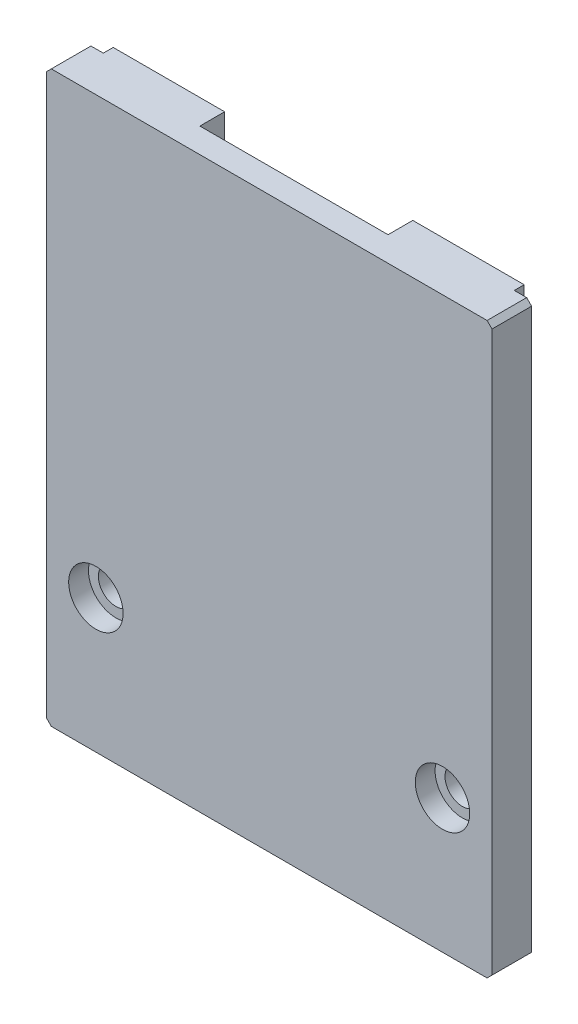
ISO-10303-21;
HEADER;
FILE_DESCRIPTION(('STEP AP214'),'2;1');
FILE_NAME('part.step','',(''),(''),'','','');
FILE_SCHEMA(('AUTOMOTIVE_DESIGN { 1 0 10303 214 1 1 1 1 }'));
ENDSEC;
DATA;
#1=APPLICATION_CONTEXT('core data for automotive mechanical design processes');
#2=APPLICATION_PROTOCOL_DEFINITION('international standard','automotive_design',2000,#1);
#3=PRODUCT_CONTEXT('',#1,'mechanical');
#4=PRODUCT('Part','Part','',(#3));
#5=PRODUCT_RELATED_PRODUCT_CATEGORY('part','',(#4));
#6=PRODUCT_DEFINITION_FORMATION('','',#4);
#7=PRODUCT_DEFINITION_CONTEXT('part definition',#1,'design');
#8=PRODUCT_DEFINITION('design','',#6,#7);
#9=PRODUCT_DEFINITION_SHAPE('','',#8);
#10=(LENGTH_UNIT() NAMED_UNIT(*) SI_UNIT(.MILLI.,.METRE.));
#11=(NAMED_UNIT(*) PLANE_ANGLE_UNIT() SI_UNIT($,.RADIAN.));
#12=(NAMED_UNIT(*) SI_UNIT($,.STERADIAN.) SOLID_ANGLE_UNIT());
#13=UNCERTAINTY_MEASURE_WITH_UNIT(LENGTH_MEASURE(1.E-05),#10,'distance_accuracy_value','');
#14=(GEOMETRIC_REPRESENTATION_CONTEXT(3) GLOBAL_UNCERTAINTY_ASSIGNED_CONTEXT((#13)) GLOBAL_UNIT_ASSIGNED_CONTEXT((#10,
#11,#12)) REPRESENTATION_CONTEXT('',''));
#15=CARTESIAN_POINT('',(0.,0.,0.));
#16=DIRECTION('',(0.,0.,1.));
#17=DIRECTION('',(1.,0.,0.));
#18=AXIS2_PLACEMENT_3D('',#15,#16,#17);
#19=CARTESIAN_POINT('',(13.,-19.,-10.));
#20=DIRECTION('',(0.,0.,1.));
#21=DIRECTION('',(1.,0.,0.));
#22=AXIS2_PLACEMENT_3D('',#19,#20,#21);
#23=CYLINDRICAL_SURFACE('',#22,6.);
#24=DIRECTION('',(0.,0.,-1.));
#25=VECTOR('',#24,1.);
#26=CARTESIAN_POINT('',(19.,-19.,-10.));
#27=LINE('',#26,#25);
#28=CARTESIAN_POINT('',(19.,-19.,-5.));
#29=VERTEX_POINT('',#28);
#30=CARTESIAN_POINT('',(19.,-19.,-10.));
#31=VERTEX_POINT('',#30);
#32=EDGE_CURVE('E165',#29,#31,#27,.T.);
#33=ORIENTED_EDGE('',*,*,#32,.T.);
#34=CARTESIAN_POINT('',(13.,-19.,-10.));
#35=DIRECTION('',(0.,0.,1.));
#36=DIRECTION('',(1.,0.,0.));
#37=AXIS2_PLACEMENT_3D('',#34,#35,#36);
#38=CIRCLE('',#37,6.);
#39=CARTESIAN_POINT('',(13.,-25.,-10.));
#40=VERTEX_POINT('',#39);
#41=EDGE_CURVE('E173',#31,#40,#38,.F.);
#42=ORIENTED_EDGE('',*,*,#41,.T.);
#43=DIRECTION('',(0.,0.,-1.));
#44=VECTOR('',#43,1.);
#45=CARTESIAN_POINT('',(13.,-25.,-10.));
#46=LINE('',#45,#44);
#47=CARTESIAN_POINT('',(13.,-25.,-5.));
#48=VERTEX_POINT('',#47);
#49=EDGE_CURVE('E234',#40,#48,#46,.F.);
#50=ORIENTED_EDGE('',*,*,#49,.T.);
#51=CARTESIAN_POINT('',(13.,-19.,-5.));
#52=DIRECTION('',(0.,0.,1.));
#53=DIRECTION('',(1.,0.,0.));
#54=AXIS2_PLACEMENT_3D('',#51,#52,#53);
#55=CIRCLE('',#54,6.);
#56=EDGE_CURVE('E212',#48,#29,#55,.T.);
#57=ORIENTED_EDGE('',*,*,#56,.T.);
#58=EDGE_LOOP('',(#33,#42,#50,#57));
#59=FACE_BOUND('',#58,.T.);
#60=ADVANCED_FACE('F16',(#59),#23,.F.);
#61=CARTESIAN_POINT('',(13.,-25.,-10.));
#62=DIRECTION('',(0.,-1.,0.));
#63=DIRECTION('',(0.,0.,-1.));
#64=AXIS2_PLACEMENT_3D('',#61,#62,#63);
#65=PLANE('',#64);
#66=ORIENTED_EDGE('',*,*,#49,.F.);
#67=DIRECTION('',(1.,0.,0.));
#68=VECTOR('',#67,1.);
#69=CARTESIAN_POINT('',(0.,-25.,-10.));
#70=LINE('',#69,#68);
#71=CARTESIAN_POINT('',(-13.,-25.,-10.));
#72=VERTEX_POINT('',#71);
#73=EDGE_CURVE('E211',#40,#72,#70,.F.);
#74=ORIENTED_EDGE('',*,*,#73,.T.);
#75=DIRECTION('',(0.,0.,1.));
#76=VECTOR('',#75,1.);
#77=CARTESIAN_POINT('',(-13.,-25.,-10.));
#78=LINE('',#77,#76);
#79=CARTESIAN_POINT('',(-13.,-25.,-5.));
#80=VERTEX_POINT('',#79);
#81=EDGE_CURVE('E226',#72,#80,#78,.T.);
#82=ORIENTED_EDGE('',*,*,#81,.T.);
#83=DIRECTION('',(1.,0.,0.));
#84=VECTOR('',#83,1.);
#85=CARTESIAN_POINT('',(0.,-25.,-5.));
#86=LINE('',#85,#84);
#87=EDGE_CURVE('E164',#80,#48,#86,.T.);
#88=ORIENTED_EDGE('',*,*,#87,.T.);
#89=EDGE_LOOP('',(#66,#74,#82,#88));
#90=FACE_BOUND('',#89,.T.);
#91=ADVANCED_FACE('F309',(#90),#65,.F.);
#92=CARTESIAN_POINT('',(-13.,-19.,-10.));
#93=DIRECTION('',(0.,0.,1.));
#94=DIRECTION('',(1.,0.,0.));
#95=AXIS2_PLACEMENT_3D('',#92,#93,#94);
#96=CYLINDRICAL_SURFACE('',#95,6.);
#97=ORIENTED_EDGE('',*,*,#81,.F.);
#98=CARTESIAN_POINT('',(-13.,-19.,-10.));
#99=DIRECTION('',(0.,0.,1.));
#100=DIRECTION('',(1.,0.,0.));
#101=AXIS2_PLACEMENT_3D('',#98,#99,#100);
#102=CIRCLE('',#101,6.);
#103=CARTESIAN_POINT('',(-19.,-19.,-10.));
#104=VERTEX_POINT('',#103);
#105=EDGE_CURVE('E151',#72,#104,#102,.F.);
#106=ORIENTED_EDGE('',*,*,#105,.T.);
#107=DIRECTION('',(0.,0.,1.));
#108=VECTOR('',#107,1.);
#109=CARTESIAN_POINT('',(-19.,-19.,-10.));
#110=LINE('',#109,#108);
#111=CARTESIAN_POINT('',(-19.,-19.,-5.));
#112=VERTEX_POINT('',#111);
#113=EDGE_CURVE('E145',#104,#112,#110,.T.);
#114=ORIENTED_EDGE('',*,*,#113,.T.);
#115=CARTESIAN_POINT('',(-13.,-19.,-5.));
#116=DIRECTION('',(0.,0.,1.));
#117=DIRECTION('',(1.,0.,0.));
#118=AXIS2_PLACEMENT_3D('',#115,#116,#117);
#119=CIRCLE('',#118,6.);
#120=EDGE_CURVE('E20',#112,#80,#119,.T.);
#121=ORIENTED_EDGE('',*,*,#120,.T.);
#122=EDGE_LOOP('',(#97,#106,#114,#121));
#123=FACE_BOUND('',#122,.T.);
#124=ADVANCED_FACE('F148',(#123),#96,.F.);
#125=CARTESIAN_POINT('',(35.,-30.5,-4.));
#126=DIRECTION('',(0.,0.,-1.));
#127=DIRECTION('',(-1.,0.,0.));
#128=AXIS2_PLACEMENT_3D('',#125,#126,#127);
#129=CYLINDRICAL_SURFACE('',#128,3.5);
#130=CARTESIAN_POINT('',(35.,-30.5,-4.));
#131=DIRECTION('',(0.,0.,-1.));
#132=DIRECTION('',(-1.,0.,0.));
#133=AXIS2_PLACEMENT_3D('',#130,#131,#132);
#134=CIRCLE('',#133,3.5);
#135=CARTESIAN_POINT('',(31.5,-30.5,-4.));
#136=VERTEX_POINT('',#135);
#137=EDGE_CURVE('E197',#136,#136,#134,.F.);
#138=ORIENTED_EDGE('',*,*,#137,.T.);
#139=EDGE_LOOP('',(#138));
#140=FACE_BOUND('',#139,.T.);
#141=CARTESIAN_POINT('',(35.,-30.5,-10.));
#142=DIRECTION('',(0.,0.,-1.));
#143=DIRECTION('',(-1.,0.,0.));
#144=AXIS2_PLACEMENT_3D('',#141,#142,#143);
#145=CIRCLE('',#144,3.5);
#146=CARTESIAN_POINT('',(31.5,-30.5,-10.));
#147=VERTEX_POINT('',#146);
#148=EDGE_CURVE('E201',#147,#147,#145,.T.);
#149=ORIENTED_EDGE('',*,*,#148,.T.);
#150=EDGE_LOOP('',(#149));
#151=FACE_BOUND('',#150,.T.);
#152=ADVANCED_FACE('F481',(#140,#151),#129,.F.);
#153=CARTESIAN_POINT('',(-35.,-30.5,-4.));
#154=DIRECTION('',(0.,0.,-1.));
#155=DIRECTION('',(-1.,0.,0.));
#156=AXIS2_PLACEMENT_3D('',#153,#154,#155);
#157=CYLINDRICAL_SURFACE('',#156,3.5);
#158=CARTESIAN_POINT('',(-35.,-30.5,-4.));
#159=DIRECTION('',(0.,0.,-1.));
#160=DIRECTION('',(-1.,0.,0.));
#161=AXIS2_PLACEMENT_3D('',#158,#159,#160);
#162=CIRCLE('',#161,3.5);
#163=CARTESIAN_POINT('',(-38.5,-30.5,-4.));
#164=VERTEX_POINT('',#163);
#165=EDGE_CURVE('E193',#164,#164,#162,.F.);
#166=ORIENTED_EDGE('',*,*,#165,.T.);
#167=EDGE_LOOP('',(#166));
#168=FACE_BOUND('',#167,.T.);
#169=CARTESIAN_POINT('',(-35.,-30.5,-10.));
#170=DIRECTION('',(0.,0.,-1.));
#171=DIRECTION('',(-1.,0.,0.));
#172=AXIS2_PLACEMENT_3D('',#169,#170,#171);
#173=CIRCLE('',#172,3.5);
#174=CARTESIAN_POINT('',(-38.5,-30.5,-10.));
#175=VERTEX_POINT('',#174);
#176=EDGE_CURVE('E205',#175,#175,#173,.T.);
#177=ORIENTED_EDGE('',*,*,#176,.T.);
#178=EDGE_LOOP('',(#177));
#179=FACE_BOUND('',#178,.T.);
#180=ADVANCED_FACE('F478',(#168,#179),#157,.F.);
#181=CARTESIAN_POINT('',(-44.5,-57.,0.));
#182=DIRECTION('',(-0.707106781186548,-0.707106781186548,0.));
#183=DIRECTION('',(0.707106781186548,-0.707106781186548,0.));
#184=AXIS2_PLACEMENT_3D('',#181,#182,#183);
#185=PLANE('',#184);
#186=DIRECTION('',(0.707106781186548,-0.707106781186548,0.));
#187=VECTOR('',#186,1.);
#188=CARTESIAN_POINT('',(-44.5,-57.,0.));
#189=LINE('',#188,#187);
#190=CARTESIAN_POINT('',(-44.,-57.5,0.));
#191=VERTEX_POINT('',#190);
#192=CARTESIAN_POINT('',(-45.,-56.5,0.));
#193=VERTEX_POINT('',#192);
#194=EDGE_CURVE('E225',#191,#193,#189,.F.);
#195=ORIENTED_EDGE('',*,*,#194,.T.);
#196=DIRECTION('',(0.,0.,1.));
#197=VECTOR('',#196,1.);
#198=CARTESIAN_POINT('',(-45.,-56.5,0.));
#199=LINE('',#198,#197);
#200=CARTESIAN_POINT('',(-45.,-56.5,-8.));
#201=VERTEX_POINT('',#200);
#202=EDGE_CURVE('E281',#201,#193,#199,.T.);
#203=ORIENTED_EDGE('',*,*,#202,.F.);
#204=DIRECTION('',(0.707106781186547,-0.707106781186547,0.));
#205=VECTOR('',#204,1.);
#206=CARTESIAN_POINT('',(-45.,-56.5,-8.));
#207=LINE('',#206,#205);
#208=CARTESIAN_POINT('',(-44.,-57.5,-8.));
#209=VERTEX_POINT('',#208);
#210=EDGE_CURVE('E299',#201,#209,#207,.T.);
#211=ORIENTED_EDGE('',*,*,#210,.T.);
#212=DIRECTION('',(0.,0.,-1.));
#213=VECTOR('',#212,1.);
#214=CARTESIAN_POINT('',(-44.,-57.5,0.));
#215=LINE('',#214,#213);
#216=EDGE_CURVE('E266',#191,#209,#215,.T.);
#217=ORIENTED_EDGE('',*,*,#216,.F.);
#218=EDGE_LOOP('',(#195,#203,#211,#217));
#219=FACE_BOUND('',#218,.T.);
#220=ADVANCED_FACE('F365',(#219),#185,.T.);
#221=CARTESIAN_POINT('',(-22.5,-57.,-9.5));
#222=DIRECTION('',(0.,-0.707106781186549,-0.707106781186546));
#223=DIRECTION('',(0.,0.707106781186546,-0.707106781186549));
#224=AXIS2_PLACEMENT_3D('',#221,#222,#223);
#225=PLANE('',#224);
#226=DIRECTION('',(0.,0.707106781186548,-0.707106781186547));
#227=VECTOR('',#226,1.);
#228=CARTESIAN_POINT('',(-41.5,-57.5,-9.));
#229=LINE('',#228,#227);
#230=CARTESIAN_POINT('',(-41.5,-57.5,-9.));
#231=VERTEX_POINT('',#230);
#232=CARTESIAN_POINT('',(-41.5,-56.5,-10.));
#233=VERTEX_POINT('',#232);
#234=EDGE_CURVE('E204',#231,#233,#229,.T.);
#235=ORIENTED_EDGE('',*,*,#234,.T.);
#236=DIRECTION('',(1.,0.,0.));
#237=VECTOR('',#236,1.);
#238=CARTESIAN_POINT('',(0.,-56.5,-10.));
#239=LINE('',#238,#237);
#240=CARTESIAN_POINT('',(41.5,-56.5,-10.));
#241=VERTEX_POINT('',#240);
#242=EDGE_CURVE('E305',#233,#241,#239,.T.);
#243=ORIENTED_EDGE('',*,*,#242,.T.);
#244=DIRECTION('',(0.,-0.707106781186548,0.707106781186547));
#245=VECTOR('',#244,1.);
#246=CARTESIAN_POINT('',(41.5,-56.5,-10.));
#247=LINE('',#246,#245);
#248=CARTESIAN_POINT('',(41.5,-57.5,-9.));
#249=VERTEX_POINT('',#248);
#250=EDGE_CURVE('E221',#241,#249,#247,.T.);
#251=ORIENTED_EDGE('',*,*,#250,.T.);
#252=DIRECTION('',(1.,0.,0.));
#253=VECTOR('',#252,1.);
#254=CARTESIAN_POINT('',(-45.,-57.5,-9.));
#255=LINE('',#254,#253);
#256=EDGE_CURVE('E257',#231,#249,#255,.T.);
#257=ORIENTED_EDGE('',*,*,#256,.F.);
#258=EDGE_LOOP('',(#235,#243,#251,#257));
#259=FACE_BOUND('',#258,.T.);
#260=ADVANCED_FACE('F331',(#259),#225,.T.);
#261=CARTESIAN_POINT('',(44.5,-57.,0.));
#262=DIRECTION('',(0.707106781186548,-0.707106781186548,0.));
#263=DIRECTION('',(0.707106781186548,0.707106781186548,0.));
#264=AXIS2_PLACEMENT_3D('',#261,#262,#263);
#265=PLANE('',#264);
#266=DIRECTION('',(0.707106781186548,0.707106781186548,0.));
#267=VECTOR('',#266,1.);
#268=CARTESIAN_POINT('',(44.5,-57.,0.));
#269=LINE('',#268,#267);
#270=CARTESIAN_POINT('',(45.,-56.5,0.));
#271=VERTEX_POINT('',#270);
#272=CARTESIAN_POINT('',(44.,-57.5,0.));
#273=VERTEX_POINT('',#272);
#274=EDGE_CURVE('E223',#271,#273,#269,.F.);
#275=ORIENTED_EDGE('',*,*,#274,.T.);
#276=DIRECTION('',(0.,0.,-1.));
#277=VECTOR('',#276,1.);
#278=CARTESIAN_POINT('',(44.,-57.5,0.));
#279=LINE('',#278,#277);
#280=CARTESIAN_POINT('',(44.,-57.5,-8.));
#281=VERTEX_POINT('',#280);
#282=EDGE_CURVE('E269',#281,#273,#279,.F.);
#283=ORIENTED_EDGE('',*,*,#282,.F.);
#284=DIRECTION('',(0.707106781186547,0.707106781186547,0.));
#285=VECTOR('',#284,1.);
#286=CARTESIAN_POINT('',(44.,-57.5,-8.));
#287=LINE('',#286,#285);
#288=CARTESIAN_POINT('',(45.,-56.5,-8.));
#289=VERTEX_POINT('',#288);
#290=EDGE_CURVE('E287',#281,#289,#287,.T.);
#291=ORIENTED_EDGE('',*,*,#290,.T.);
#292=DIRECTION('',(0.,0.,-1.));
#293=VECTOR('',#292,1.);
#294=CARTESIAN_POINT('',(45.,-56.5,0.));
#295=LINE('',#294,#293);
#296=EDGE_CURVE('E243',#271,#289,#295,.T.);
#297=ORIENTED_EDGE('',*,*,#296,.F.);
#298=EDGE_LOOP('',(#275,#283,#291,#297));
#299=FACE_BOUND('',#298,.T.);
#300=ADVANCED_FACE('F372',(#299),#265,.T.);
#301=CARTESIAN_POINT('',(41.5,-57.5,-8.));
#302=DIRECTION('',(-1.,0.,0.));
#303=DIRECTION('',(0.,0.,1.));
#304=AXIS2_PLACEMENT_3D('',#301,#302,#303);
#305=PLANE('',#304);
#306=DIRECTION('',(0.,1.,0.));
#307=VECTOR('',#306,1.);
#308=CARTESIAN_POINT('',(41.5,-57.5,-8.));
#309=LINE('',#308,#307);
#310=CARTESIAN_POINT('',(41.5,57.5,-8.));
#311=VERTEX_POINT('',#310);
#312=CARTESIAN_POINT('',(41.5,-57.5,-8.));
#313=VERTEX_POINT('',#312);
#314=EDGE_CURVE('E289',#311,#313,#309,.F.);
#315=ORIENTED_EDGE('',*,*,#314,.T.);
#316=DIRECTION('',(0.,0.,-1.));
#317=VECTOR('',#316,1.);
#318=CARTESIAN_POINT('',(41.5,-57.5,0.));
#319=LINE('',#318,#317);
#320=EDGE_CURVE('E275',#249,#313,#319,.F.);
#321=ORIENTED_EDGE('',*,*,#320,.F.);
#322=ORIENTED_EDGE('',*,*,#250,.F.);
#323=DIRECTION('',(0.,1.,0.));
#324=VECTOR('',#323,1.);
#325=CARTESIAN_POINT('',(41.5,0.,-10.));
#326=LINE('',#325,#324);
#327=CARTESIAN_POINT('',(41.5,57.5,-10.));
#328=VERTEX_POINT('',#327);
#329=EDGE_CURVE('E208',#241,#328,#326,.T.);
#330=ORIENTED_EDGE('',*,*,#329,.T.);
#331=DIRECTION('',(0.,0.,1.));
#332=VECTOR('',#331,1.);
#333=CARTESIAN_POINT('',(41.5,57.5,0.));
#334=LINE('',#333,#332);
#335=EDGE_CURVE('E240',#311,#328,#334,.F.);
#336=ORIENTED_EDGE('',*,*,#335,.F.);
#337=EDGE_LOOP('',(#315,#321,#322,#330,#336));
#338=FACE_BOUND('',#337,.T.);
#339=ADVANCED_FACE('F326',(#338),#305,.F.);
#340=CARTESIAN_POINT('',(19.,57.5,-10.));
#341=DIRECTION('',(1.,0.,0.));
#342=DIRECTION('',(0.,0.,-1.));
#343=AXIS2_PLACEMENT_3D('',#340,#341,#342);
#344=PLANE('',#343);
#345=DIRECTION('',(0.,0.,1.));
#346=VECTOR('',#345,1.);
#347=CARTESIAN_POINT('',(19.,57.5,0.));
#348=LINE('',#347,#346);
#349=CARTESIAN_POINT('',(19.,57.5,-10.));
#350=VERTEX_POINT('',#349);
#351=CARTESIAN_POINT('',(19.,57.5,-5.));
#352=VERTEX_POINT('',#351);
#353=EDGE_CURVE('E180',#350,#352,#348,.T.);
#354=ORIENTED_EDGE('',*,*,#353,.F.);
#355=DIRECTION('',(0.,1.,0.));
#356=VECTOR('',#355,1.);
#357=CARTESIAN_POINT('',(19.,0.,-10.));
#358=LINE('',#357,#356);
#359=EDGE_CURVE('E170',#350,#31,#358,.F.);
#360=ORIENTED_EDGE('',*,*,#359,.T.);
#361=ORIENTED_EDGE('',*,*,#32,.F.);
#362=DIRECTION('',(0.,1.,0.));
#363=VECTOR('',#362,1.);
#364=CARTESIAN_POINT('',(19.,17.1789500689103,-5.));
#365=LINE('',#364,#363);
#366=EDGE_CURVE('E156',#29,#352,#365,.T.);
#367=ORIENTED_EDGE('',*,*,#366,.T.);
#368=EDGE_LOOP('',(#354,#360,#361,#367));
#369=FACE_BOUND('',#368,.T.);
#370=ADVANCED_FACE('F322',(#369),#344,.F.);
#371=CARTESIAN_POINT('',(0.,17.1789500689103,-5.));
#372=DIRECTION('',(0.,0.,1.));
#373=DIRECTION('',(1.,0.,0.));
#374=AXIS2_PLACEMENT_3D('',#371,#372,#373);
#375=PLANE('',#374);
#376=ORIENTED_EDGE('',*,*,#56,.F.);
#377=ORIENTED_EDGE('',*,*,#87,.F.);
#378=ORIENTED_EDGE('',*,*,#120,.F.);
#379=DIRECTION('',(0.,1.,0.));
#380=VECTOR('',#379,1.);
#381=CARTESIAN_POINT('',(-19.,-19.,-5.));
#382=LINE('',#381,#380);
#383=CARTESIAN_POINT('',(-19.,57.5,-5.));
#384=VERTEX_POINT('',#383);
#385=EDGE_CURVE('E155',#112,#384,#382,.T.);
#386=ORIENTED_EDGE('',*,*,#385,.T.);
#387=DIRECTION('',(1.,0.,0.));
#388=VECTOR('',#387,1.);
#389=CARTESIAN_POINT('',(45.,57.5,-5.));
#390=LINE('',#389,#388);
#391=EDGE_CURVE('E179',#352,#384,#390,.F.);
#392=ORIENTED_EDGE('',*,*,#391,.F.);
#393=ORIENTED_EDGE('',*,*,#366,.F.);
#394=EDGE_LOOP('',(#376,#377,#378,#386,#392,#393));
#395=FACE_BOUND('',#394,.T.);
#396=ADVANCED_FACE('F160',(#395),#375,.F.);
#397=CARTESIAN_POINT('',(-19.,-19.,-10.));
#398=DIRECTION('',(-1.,0.,0.));
#399=DIRECTION('',(0.,0.,1.));
#400=AXIS2_PLACEMENT_3D('',#397,#398,#399);
#401=PLANE('',#400);
#402=ORIENTED_EDGE('',*,*,#113,.F.);
#403=DIRECTION('',(0.,1.,0.));
#404=VECTOR('',#403,1.);
#405=CARTESIAN_POINT('',(-19.,0.,-10.));
#406=LINE('',#405,#404);
#407=CARTESIAN_POINT('',(-19.,57.5,-10.));
#408=VERTEX_POINT('',#407);
#409=EDGE_CURVE('E210',#104,#408,#406,.T.);
#410=ORIENTED_EDGE('',*,*,#409,.T.);
#411=DIRECTION('',(0.,0.,1.));
#412=VECTOR('',#411,1.);
#413=CARTESIAN_POINT('',(-19.,57.5,0.));
#414=LINE('',#413,#412);
#415=EDGE_CURVE('E168',#384,#408,#414,.F.);
#416=ORIENTED_EDGE('',*,*,#415,.F.);
#417=ORIENTED_EDGE('',*,*,#385,.F.);
#418=EDGE_LOOP('',(#402,#410,#416,#417));
#419=FACE_BOUND('',#418,.T.);
#420=ADVANCED_FACE('F166',(#419),#401,.F.);
#421=CARTESIAN_POINT('',(0.,0.,-10.));
#422=DIRECTION('',(0.,0.,1.));
#423=DIRECTION('',(1.,0.,0.));
#424=AXIS2_PLACEMENT_3D('',#421,#422,#423);
#425=PLANE('',#424);
#426=ORIENTED_EDGE('',*,*,#148,.F.);
#427=EDGE_LOOP('',(#426));
#428=FACE_BOUND('',#427,.T.);
#429=ORIENTED_EDGE('',*,*,#176,.F.);
#430=EDGE_LOOP('',(#429));
#431=FACE_BOUND('',#430,.T.);
#432=ORIENTED_EDGE('',*,*,#242,.F.);
#433=DIRECTION('',(0.,1.,0.));
#434=VECTOR('',#433,1.);
#435=CARTESIAN_POINT('',(-41.5,-57.5,-10.));
#436=LINE('',#435,#434);
#437=CARTESIAN_POINT('',(-41.5,57.5,-10.));
#438=VERTEX_POINT('',#437);
#439=EDGE_CURVE('E301',#233,#438,#436,.T.);
#440=ORIENTED_EDGE('',*,*,#439,.T.);
#441=DIRECTION('',(1.,0.,0.));
#442=VECTOR('',#441,1.);
#443=CARTESIAN_POINT('',(45.,57.5,-10.));
#444=LINE('',#443,#442);
#445=EDGE_CURVE('E228',#408,#438,#444,.F.);
#446=ORIENTED_EDGE('',*,*,#445,.F.);
#447=ORIENTED_EDGE('',*,*,#409,.F.);
#448=ORIENTED_EDGE('',*,*,#105,.F.);
#449=ORIENTED_EDGE('',*,*,#73,.F.);
#450=ORIENTED_EDGE('',*,*,#41,.F.);
#451=ORIENTED_EDGE('',*,*,#359,.F.);
#452=DIRECTION('',(1.,0.,0.));
#453=VECTOR('',#452,1.);
#454=CARTESIAN_POINT('',(45.,57.5,-10.));
#455=LINE('',#454,#453);
#456=EDGE_CURVE('E177',#328,#350,#455,.F.);
#457=ORIENTED_EDGE('',*,*,#456,.F.);
#458=ORIENTED_EDGE('',*,*,#329,.F.);
#459=EDGE_LOOP('',(#432,#440,#446,#447,#448,#449,#450,#451,#457,#458));
#460=FACE_BOUND('',#459,.T.);
#461=ADVANCED_FACE('F313',(#428,#431,#460),#425,.F.);
#462=CARTESIAN_POINT('',(-41.5,-57.5,-10.));
#463=DIRECTION('',(1.,0.,0.));
#464=DIRECTION('',(0.,0.,-1.));
#465=AXIS2_PLACEMENT_3D('',#462,#463,#464);
#466=PLANE('',#465);
#467=ORIENTED_EDGE('',*,*,#439,.F.);
#468=ORIENTED_EDGE('',*,*,#234,.F.);
#469=DIRECTION('',(0.,0.,-1.));
#470=VECTOR('',#469,1.);
#471=CARTESIAN_POINT('',(-41.5,-57.5,0.));
#472=LINE('',#471,#470);
#473=CARTESIAN_POINT('',(-41.5,-57.5,-8.));
#474=VERTEX_POINT('',#473);
#475=EDGE_CURVE('E260',#474,#231,#472,.T.);
#476=ORIENTED_EDGE('',*,*,#475,.F.);
#477=DIRECTION('',(0.,1.,0.));
#478=VECTOR('',#477,1.);
#479=CARTESIAN_POINT('',(-41.5,-57.5,-8.));
#480=LINE('',#479,#478);
#481=CARTESIAN_POINT('',(-41.5,57.5,-8.));
#482=VERTEX_POINT('',#481);
#483=EDGE_CURVE('E297',#474,#482,#480,.T.);
#484=ORIENTED_EDGE('',*,*,#483,.T.);
#485=DIRECTION('',(0.,0.,1.));
#486=VECTOR('',#485,1.);
#487=CARTESIAN_POINT('',(-41.5,57.5,0.));
#488=LINE('',#487,#486);
#489=EDGE_CURVE('E231',#438,#482,#488,.T.);
#490=ORIENTED_EDGE('',*,*,#489,.F.);
#491=EDGE_LOOP('',(#467,#468,#476,#484,#490));
#492=FACE_BOUND('',#491,.T.);
#493=ADVANCED_FACE('F334',(#492),#466,.F.);
#494=CARTESIAN_POINT('',(-41.5,-57.5,-8.));
#495=DIRECTION('',(0.,0.,1.));
#496=DIRECTION('',(1.,0.,0.));
#497=AXIS2_PLACEMENT_3D('',#494,#495,#496);
#498=PLANE('',#497);
#499=ORIENTED_EDGE('',*,*,#483,.F.);
#500=DIRECTION('',(1.,0.,0.));
#501=VECTOR('',#500,1.);
#502=CARTESIAN_POINT('',(-45.,-57.5,-8.));
#503=LINE('',#502,#501);
#504=EDGE_CURVE('E263',#209,#474,#503,.T.);
#505=ORIENTED_EDGE('',*,*,#504,.F.);
#506=ORIENTED_EDGE('',*,*,#210,.F.);
#507=DIRECTION('',(0.,1.,0.));
#508=VECTOR('',#507,1.);
#509=CARTESIAN_POINT('',(-45.,57.5,-8.));
#510=LINE('',#509,#508);
#511=CARTESIAN_POINT('',(-45.,56.5,-8.));
#512=VERTEX_POINT('',#511);
#513=EDGE_CURVE('E196',#512,#201,#510,.F.);
#514=ORIENTED_EDGE('',*,*,#513,.F.);
#515=DIRECTION('',(-0.707106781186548,-0.707106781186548,0.));
#516=VECTOR('',#515,1.);
#517=CARTESIAN_POINT('',(-44.5,57.,-8.));
#518=LINE('',#517,#516);
#519=CARTESIAN_POINT('',(-44.,57.5,-8.));
#520=VERTEX_POINT('',#519);
#521=EDGE_CURVE('E294',#520,#512,#518,.T.);
#522=ORIENTED_EDGE('',*,*,#521,.F.);
#523=DIRECTION('',(1.,0.,0.));
#524=VECTOR('',#523,1.);
#525=CARTESIAN_POINT('',(45.,57.5,-8.));
#526=LINE('',#525,#524);
#527=EDGE_CURVE('E337',#482,#520,#526,.F.);
#528=ORIENTED_EDGE('',*,*,#527,.F.);
#529=EDGE_LOOP('',(#499,#505,#506,#514,#522,#528));
#530=FACE_BOUND('',#529,.T.);
#531=ADVANCED_FACE('F385',(#530),#498,.F.);
#532=CARTESIAN_POINT('',(-44.5,57.,0.));
#533=DIRECTION('',(-0.707106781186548,0.707106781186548,0.));
#534=DIRECTION('',(-0.707106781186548,-0.707106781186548,0.));
#535=AXIS2_PLACEMENT_3D('',#532,#533,#534);
#536=PLANE('',#535);
#537=DIRECTION('',(-0.707106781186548,-0.707106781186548,0.));
#538=VECTOR('',#537,1.);
#539=CARTESIAN_POINT('',(-44.5,57.,0.));
#540=LINE('',#539,#538);
#541=CARTESIAN_POINT('',(-45.,56.5,0.));
#542=VERTEX_POINT('',#541);
#543=CARTESIAN_POINT('',(-44.,57.5,0.));
#544=VERTEX_POINT('',#543);
#545=EDGE_CURVE('E292',#542,#544,#540,.F.);
#546=ORIENTED_EDGE('',*,*,#545,.T.);
#547=DIRECTION('',(0.,0.,1.));
#548=VECTOR('',#547,1.);
#549=CARTESIAN_POINT('',(-44.,57.5,0.));
#550=LINE('',#549,#548);
#551=EDGE_CURVE('E338',#520,#544,#550,.T.);
#552=ORIENTED_EDGE('',*,*,#551,.F.);
#553=ORIENTED_EDGE('',*,*,#521,.T.);
#554=DIRECTION('',(0.,0.,1.));
#555=VECTOR('',#554,1.);
#556=CARTESIAN_POINT('',(-45.,56.5,0.));
#557=LINE('',#556,#555);
#558=EDGE_CURVE('E278',#542,#512,#557,.F.);
#559=ORIENTED_EDGE('',*,*,#558,.F.);
#560=EDGE_LOOP('',(#546,#552,#553,#559));
#561=FACE_BOUND('',#560,.T.);
#562=ADVANCED_FACE('F357',(#561),#536,.T.);
#563=CARTESIAN_POINT('',(44.5,57.,0.));
#564=DIRECTION('',(0.707106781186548,0.707106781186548,0.));
#565=DIRECTION('',(-0.707106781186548,0.707106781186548,0.));
#566=AXIS2_PLACEMENT_3D('',#563,#564,#565);
#567=PLANE('',#566);
#568=DIRECTION('',(-0.707106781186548,0.707106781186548,0.));
#569=VECTOR('',#568,1.);
#570=CARTESIAN_POINT('',(44.5,57.,0.));
#571=LINE('',#570,#569);
#572=CARTESIAN_POINT('',(44.,57.5,0.));
#573=VERTEX_POINT('',#572);
#574=CARTESIAN_POINT('',(45.,56.5,0.));
#575=VERTEX_POINT('',#574);
#576=EDGE_CURVE('E35',#573,#575,#571,.F.);
#577=ORIENTED_EDGE('',*,*,#576,.T.);
#578=DIRECTION('',(0.,0.,-1.));
#579=VECTOR('',#578,1.);
#580=CARTESIAN_POINT('',(45.,56.5,0.));
#581=LINE('',#580,#579);
#582=CARTESIAN_POINT('',(45.,56.5,-8.));
#583=VERTEX_POINT('',#582);
#584=EDGE_CURVE('E247',#583,#575,#581,.F.);
#585=ORIENTED_EDGE('',*,*,#584,.F.);
#586=DIRECTION('',(-0.70710678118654,0.707106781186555,0.));
#587=VECTOR('',#586,1.);
#588=CARTESIAN_POINT('',(45.,56.5,-8.));
#589=LINE('',#588,#587);
#590=CARTESIAN_POINT('',(44.,57.5,-8.));
#591=VERTEX_POINT('',#590);
#592=EDGE_CURVE('E200',#583,#591,#589,.T.);
#593=ORIENTED_EDGE('',*,*,#592,.T.);
#594=DIRECTION('',(0.,0.,1.));
#595=VECTOR('',#594,1.);
#596=CARTESIAN_POINT('',(44.,57.5,0.));
#597=LINE('',#596,#595);
#598=EDGE_CURVE('E340',#573,#591,#597,.F.);
#599=ORIENTED_EDGE('',*,*,#598,.F.);
#600=EDGE_LOOP('',(#577,#585,#593,#599));
#601=FACE_BOUND('',#600,.T.);
#602=ADVANCED_FACE('F380',(#601),#567,.T.);
#603=CARTESIAN_POINT('',(45.,-57.5,-8.));
#604=DIRECTION('',(0.,0.,1.));
#605=DIRECTION('',(1.,0.,0.));
#606=AXIS2_PLACEMENT_3D('',#603,#604,#605);
#607=PLANE('',#606);
#608=ORIENTED_EDGE('',*,*,#592,.F.);
#609=DIRECTION('',(0.,1.,0.));
#610=VECTOR('',#609,1.);
#611=CARTESIAN_POINT('',(45.,-57.5,-8.));
#612=LINE('',#611,#610);
#613=EDGE_CURVE('E254',#289,#583,#612,.T.);
#614=ORIENTED_EDGE('',*,*,#613,.F.);
#615=ORIENTED_EDGE('',*,*,#290,.F.);
#616=DIRECTION('',(1.,0.,0.));
#617=VECTOR('',#616,1.);
#618=CARTESIAN_POINT('',(-45.,-57.5,-8.));
#619=LINE('',#618,#617);
#620=EDGE_CURVE('E272',#313,#281,#619,.T.);
#621=ORIENTED_EDGE('',*,*,#620,.F.);
#622=ORIENTED_EDGE('',*,*,#314,.F.);
#623=DIRECTION('',(1.,0.,0.));
#624=VECTOR('',#623,1.);
#625=CARTESIAN_POINT('',(45.,57.5,-8.));
#626=LINE('',#625,#624);
#627=EDGE_CURVE('E192',#591,#311,#626,.F.);
#628=ORIENTED_EDGE('',*,*,#627,.F.);
#629=EDGE_LOOP('',(#608,#614,#615,#621,#622,#628));
#630=FACE_BOUND('',#629,.T.);
#631=ADVANCED_FACE('F383',(#630),#607,.F.);
#632=CARTESIAN_POINT('',(29.39,-24.89,-4.));
#633=DIRECTION('',(0.,0.,-1.));
#634=DIRECTION('',(1.,0.,0.));
#635=AXIS2_PLACEMENT_3D('',#632,#633,#634);
#636=PLANE('',#635);
#637=ORIENTED_EDGE('',*,*,#137,.F.);
#638=EDGE_LOOP('',(#637));
#639=FACE_BOUND('',#638,.T.);
#640=CARTESIAN_POINT('',(35.,-30.5,-4.));
#641=DIRECTION('',(0.,0.,-1.));
#642=DIRECTION('',(-1.,0.,0.));
#643=AXIS2_PLACEMENT_3D('',#640,#641,#642);
#644=CIRCLE('',#643,5.49999999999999);
#645=CARTESIAN_POINT('',(29.5,-30.5,-4.));
#646=VERTEX_POINT('',#645);
#647=EDGE_CURVE('E189',#646,#646,#644,.F.);
#648=ORIENTED_EDGE('',*,*,#647,.T.);
#649=EDGE_LOOP('',(#648));
#650=FACE_BOUND('',#649,.T.);
#651=ADVANCED_FACE('F416',(#639,#650),#636,.F.);
#652=CARTESIAN_POINT('',(-40.61,-24.89,-4.));
#653=DIRECTION('',(0.,0.,-1.));
#654=DIRECTION('',(1.,0.,0.));
#655=AXIS2_PLACEMENT_3D('',#652,#653,#654);
#656=PLANE('',#655);
#657=ORIENTED_EDGE('',*,*,#165,.F.);
#658=EDGE_LOOP('',(#657));
#659=FACE_BOUND('',#658,.T.);
#660=CARTESIAN_POINT('',(-35.,-30.5,-4.));
#661=DIRECTION('',(0.,0.,-1.));
#662=DIRECTION('',(-1.,0.,0.));
#663=AXIS2_PLACEMENT_3D('',#660,#661,#662);
#664=CIRCLE('',#663,5.50000000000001);
#665=CARTESIAN_POINT('',(-40.5,-30.5,-4.));
#666=VERTEX_POINT('',#665);
#667=EDGE_CURVE('E185',#666,#666,#664,.F.);
#668=ORIENTED_EDGE('',*,*,#667,.T.);
#669=EDGE_LOOP('',(#668));
#670=FACE_BOUND('',#669,.T.);
#671=ADVANCED_FACE('F413',(#659,#670),#656,.F.);
#672=CARTESIAN_POINT('',(-45.,57.5,0.));
#673=DIRECTION('',(-1.,0.,0.));
#674=DIRECTION('',(0.,0.,1.));
#675=AXIS2_PLACEMENT_3D('',#672,#673,#674);
#676=PLANE('',#675);
#677=DIRECTION('',(0.,1.,0.));
#678=VECTOR('',#677,1.);
#679=CARTESIAN_POINT('',(-45.,0.,0.));
#680=LINE('',#679,#678);
#681=EDGE_CURVE('E188',#542,#193,#680,.F.);
#682=ORIENTED_EDGE('',*,*,#681,.F.);
#683=ORIENTED_EDGE('',*,*,#558,.T.);
#684=ORIENTED_EDGE('',*,*,#513,.T.);
#685=ORIENTED_EDGE('',*,*,#202,.T.);
#686=EDGE_LOOP('',(#682,#683,#684,#685));
#687=FACE_BOUND('',#686,.T.);
#688=ADVANCED_FACE('F360',(#687),#676,.T.);
#689=CARTESIAN_POINT('',(-45.,-57.5,0.));
#690=DIRECTION('',(0.,-1.,0.));
#691=DIRECTION('',(0.,0.,-1.));
#692=AXIS2_PLACEMENT_3D('',#689,#690,#691);
#693=PLANE('',#692);
#694=ORIENTED_EDGE('',*,*,#475,.T.);
#695=ORIENTED_EDGE('',*,*,#256,.T.);
#696=ORIENTED_EDGE('',*,*,#320,.T.);
#697=ORIENTED_EDGE('',*,*,#620,.T.);
#698=ORIENTED_EDGE('',*,*,#282,.T.);
#699=DIRECTION('',(1.,0.,0.));
#700=VECTOR('',#699,1.);
#701=CARTESIAN_POINT('',(0.,-57.5,0.));
#702=LINE('',#701,#700);
#703=EDGE_CURVE('E347',#191,#273,#702,.T.);
#704=ORIENTED_EDGE('',*,*,#703,.F.);
#705=ORIENTED_EDGE('',*,*,#216,.T.);
#706=ORIENTED_EDGE('',*,*,#504,.T.);
#707=EDGE_LOOP('',(#694,#695,#696,#697,#698,#704,#705,#706));
#708=FACE_BOUND('',#707,.T.);
#709=ADVANCED_FACE('F368',(#708),#693,.T.);
#710=CARTESIAN_POINT('',(45.,-57.5,0.));
#711=DIRECTION('',(1.,0.,0.));
#712=DIRECTION('',(0.,0.,-1.));
#713=AXIS2_PLACEMENT_3D('',#710,#711,#712);
#714=PLANE('',#713);
#715=DIRECTION('',(0.,1.,0.));
#716=VECTOR('',#715,1.);
#717=CARTESIAN_POINT('',(45.,0.,0.));
#718=LINE('',#717,#716);
#719=EDGE_CURVE('E350',#271,#575,#718,.T.);
#720=ORIENTED_EDGE('',*,*,#719,.F.);
#721=ORIENTED_EDGE('',*,*,#296,.T.);
#722=ORIENTED_EDGE('',*,*,#613,.T.);
#723=ORIENTED_EDGE('',*,*,#584,.T.);
#724=EDGE_LOOP('',(#720,#721,#722,#723));
#725=FACE_BOUND('',#724,.T.);
#726=ADVANCED_FACE('F377',(#725),#714,.T.);
#727=CARTESIAN_POINT('',(45.,57.5,0.));
#728=DIRECTION('',(0.,1.,0.));
#729=DIRECTION('',(0.,0.,1.));
#730=AXIS2_PLACEMENT_3D('',#727,#728,#729);
#731=PLANE('',#730);
#732=ORIENTED_EDGE('',*,*,#598,.T.);
#733=ORIENTED_EDGE('',*,*,#627,.T.);
#734=ORIENTED_EDGE('',*,*,#335,.T.);
#735=ORIENTED_EDGE('',*,*,#456,.T.);
#736=ORIENTED_EDGE('',*,*,#353,.T.);
#737=ORIENTED_EDGE('',*,*,#391,.T.);
#738=ORIENTED_EDGE('',*,*,#415,.T.);
#739=ORIENTED_EDGE('',*,*,#445,.T.);
#740=ORIENTED_EDGE('',*,*,#489,.T.);
#741=ORIENTED_EDGE('',*,*,#527,.T.);
#742=ORIENTED_EDGE('',*,*,#551,.T.);
#743=DIRECTION('',(1.,0.,0.));
#744=VECTOR('',#743,1.);
#745=CARTESIAN_POINT('',(0.,57.5,0.));
#746=LINE('',#745,#744);
#747=EDGE_CURVE('E184',#573,#544,#746,.F.);
#748=ORIENTED_EDGE('',*,*,#747,.F.);
#749=EDGE_LOOP('',(#732,#733,#734,#735,#736,#737,#738,#739,#740,#741,#742,#748));
#750=FACE_BOUND('',#749,.T.);
#751=ADVANCED_FACE('F319',(#750),#731,.T.);
#752=CARTESIAN_POINT('',(35.,-30.5,0.));
#753=DIRECTION('',(0.,0.,-1.));
#754=DIRECTION('',(-1.,0.,0.));
#755=AXIS2_PLACEMENT_3D('',#752,#753,#754);
#756=CYLINDRICAL_SURFACE('',#755,5.49999999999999);
#757=ORIENTED_EDGE('',*,*,#647,.F.);
#758=EDGE_LOOP('',(#757));
#759=FACE_BOUND('',#758,.T.);
#760=CARTESIAN_POINT('',(35.,-30.5,0.));
#761=DIRECTION('',(0.,0.,-1.));
#762=DIRECTION('',(-1.,0.,0.));
#763=AXIS2_PLACEMENT_3D('',#760,#761,#762);
#764=CIRCLE('',#763,5.49999999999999);
#765=CARTESIAN_POINT('',(29.5,-30.5,0.));
#766=VERTEX_POINT('',#765);
#767=EDGE_CURVE('E26',#766,#766,#764,.T.);
#768=ORIENTED_EDGE('',*,*,#767,.F.);
#769=EDGE_LOOP('',(#768));
#770=FACE_BOUND('',#769,.T.);
#771=ADVANCED_FACE('F401',(#759,#770),#756,.F.);
#772=CARTESIAN_POINT('',(-35.,-30.5,0.));
#773=DIRECTION('',(0.,0.,-1.));
#774=DIRECTION('',(-1.,0.,0.));
#775=AXIS2_PLACEMENT_3D('',#772,#773,#774);
#776=CYLINDRICAL_SURFACE('',#775,5.50000000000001);
#777=ORIENTED_EDGE('',*,*,#667,.F.);
#778=EDGE_LOOP('',(#777));
#779=FACE_BOUND('',#778,.T.);
#780=CARTESIAN_POINT('',(-35.,-30.5,0.));
#781=DIRECTION('',(0.,0.,-1.));
#782=DIRECTION('',(-1.,0.,0.));
#783=AXIS2_PLACEMENT_3D('',#780,#781,#782);
#784=CIRCLE('',#783,5.50000000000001);
#785=CARTESIAN_POINT('',(-40.5,-30.5,0.));
#786=VERTEX_POINT('',#785);
#787=EDGE_CURVE('E11',#786,#786,#784,.T.);
#788=ORIENTED_EDGE('',*,*,#787,.F.);
#789=EDGE_LOOP('',(#788));
#790=FACE_BOUND('',#789,.T.);
#791=ADVANCED_FACE('F18',(#779,#790),#776,.F.);
#792=CARTESIAN_POINT('',(0.,0.,0.));
#793=DIRECTION('',(0.,0.,1.));
#794=DIRECTION('',(1.,0.,0.));
#795=AXIS2_PLACEMENT_3D('',#792,#793,#794);
#796=PLANE('',#795);
#797=ORIENTED_EDGE('',*,*,#787,.T.);
#798=EDGE_LOOP('',(#797));
#799=FACE_BOUND('',#798,.T.);
#800=ORIENTED_EDGE('',*,*,#767,.T.);
#801=EDGE_LOOP('',(#800));
#802=FACE_BOUND('',#801,.T.);
#803=ORIENTED_EDGE('',*,*,#576,.F.);
#804=ORIENTED_EDGE('',*,*,#747,.T.);
#805=ORIENTED_EDGE('',*,*,#545,.F.);
#806=ORIENTED_EDGE('',*,*,#681,.T.);
#807=ORIENTED_EDGE('',*,*,#194,.F.);
#808=ORIENTED_EDGE('',*,*,#703,.T.);
#809=ORIENTED_EDGE('',*,*,#274,.F.);
#810=ORIENTED_EDGE('',*,*,#719,.T.);
#811=EDGE_LOOP('',(#803,#804,#805,#806,#807,#808,#809,#810));
#812=FACE_BOUND('',#811,.T.);
#813=ADVANCED_FACE('F353',(#799,#802,#812),#796,.T.);
#814=CLOSED_SHELL('',(#60,#91,#124,#152,#180,#220,#260,#300,#339,#370,#396,#420,#461,#493,#531,
#562,#602,#631,#651,#671,#688,#709,#726,#751,#771,#791,#813));
#815=MANIFOLD_SOLID_BREP('B1',#814);
#816=ADVANCED_BREP_SHAPE_REPRESENTATION('',(#18,#815),#14);
#817=SHAPE_DEFINITION_REPRESENTATION(#9,#816);
ENDSEC;
END-ISO-10303-21;
